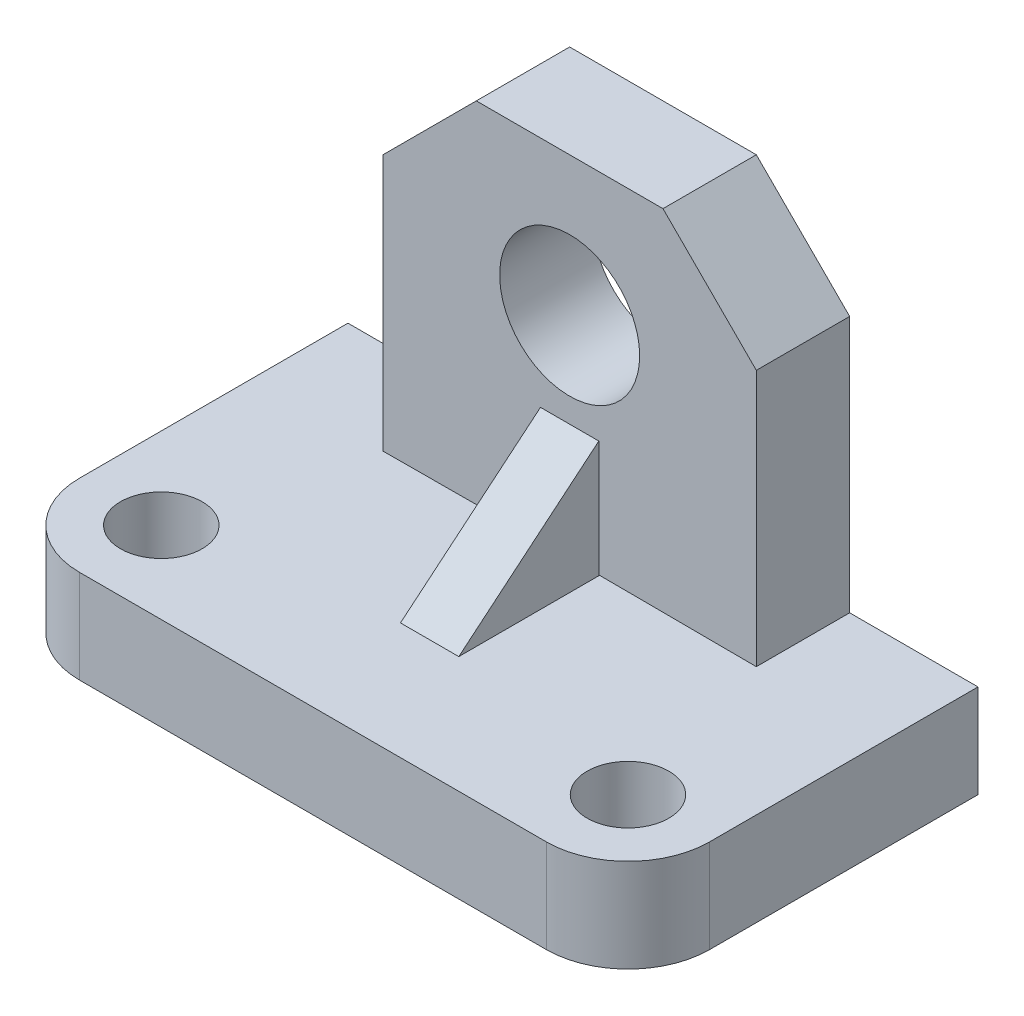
from build123d import *

# Parameters (mm, degrees)
SKETCH_1_R      = 3.5
EXTRUDE_1_DEPTH = 8
SKETCH_2_R      = 6
EXTRUDE_2_DEPTH = 8
EXTRUDE_8_DEPTH = 2.5


with BuildPart() as part:
    # Sketch 1 → Extrude 1 (new body)
    with BuildSketch(Plane(origin=(0, 0, 0), x_dir=(1, 0, 0), z_dir=(0, 1, 0))):
        with BuildLine():
            Line((27, 0), (-27, 0))
            Line((-27, 0), (-27, -23))
            ThreePointArc((-27, -23), (-24.949747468, -27.949747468), (-20, -30))
            Line((-20, -30), (20, -30))
            ThreePointArc((20, -30), (24.949747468, -27.949747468), (27, -23))
            Line((27, -23), (27, 0))
        make_face()
        with Locations(Location((-20, -23, 0), (0, 0, 270))):
            Circle(SKETCH_1_R, mode=Mode.SUBTRACT)
        with Locations(Location((20, -23, 0), (0, 0, 90))):
            Circle(SKETCH_1_R, mode=Mode.SUBTRACT)
    extrude(amount=EXTRUDE_1_DEPTH)


with BuildPart() as body_2:
    # Sketch 2 → Extrude 2 (new body)
    with BuildSketch(Plane.XY):
        Polygon((0, 8.077158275), (-16, 8), (-16, 30), (-8, 38), (8, 38), (16, 30), (16, 8), align=None)
        with Locations((0, 26.077158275)):
            Circle(SKETCH_2_R, mode=Mode.SUBTRACT)
    extrude(amount=EXTRUDE_2_DEPTH)


with BuildPart() as body_3:
    # Sketch 3 → Extrude 8 (new, symmetric)
    with BuildSketch(Plane(origin=(0, 0, 0), x_dir=(0, 0, -1), z_dir=(1, 0, 0))):
        Polygon((-8, 18), (-20, 8), (-8, 8), align=None)
    extrude(amount=EXTRUDE_8_DEPTH, both=True)


solid = Compound([part.part, body_2.part, body_3.part])
